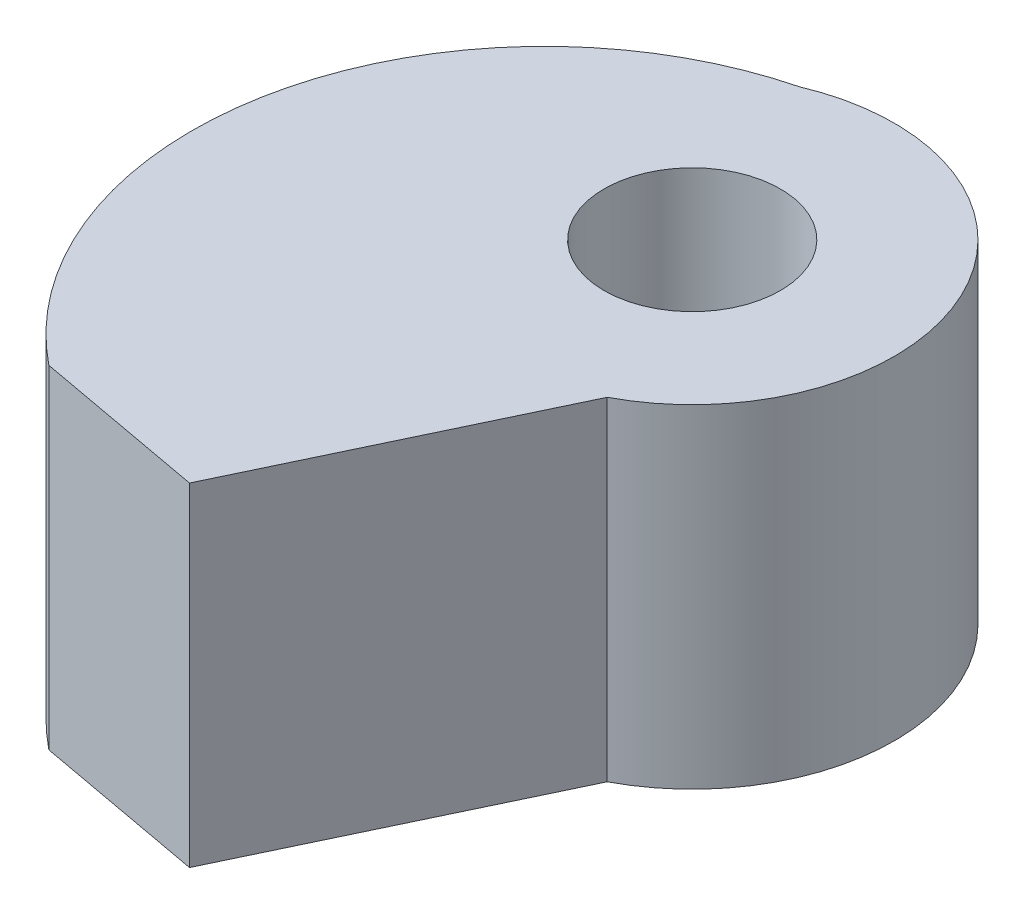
ISO-10303-21;
HEADER;
FILE_DESCRIPTION(('STEP AP214'),'2;1');
FILE_NAME('part.step','',(''),(''),'','','');
FILE_SCHEMA(('AUTOMOTIVE_DESIGN { 1 0 10303 214 1 1 1 1 }'));
ENDSEC;
DATA;
#1=APPLICATION_CONTEXT('core data for automotive mechanical design processes');
#2=APPLICATION_PROTOCOL_DEFINITION('international standard','automotive_design',2000,#1);
#3=PRODUCT_CONTEXT('',#1,'mechanical');
#4=PRODUCT('Part','Part','',(#3));
#5=PRODUCT_RELATED_PRODUCT_CATEGORY('part','',(#4));
#6=PRODUCT_DEFINITION_FORMATION('','',#4);
#7=PRODUCT_DEFINITION_CONTEXT('part definition',#1,'design');
#8=PRODUCT_DEFINITION('design','',#6,#7);
#9=PRODUCT_DEFINITION_SHAPE('','',#8);
#10=(LENGTH_UNIT() NAMED_UNIT(*) SI_UNIT(.MILLI.,.METRE.));
#11=(NAMED_UNIT(*) PLANE_ANGLE_UNIT() SI_UNIT($,.RADIAN.));
#12=(NAMED_UNIT(*) SI_UNIT($,.STERADIAN.) SOLID_ANGLE_UNIT());
#13=UNCERTAINTY_MEASURE_WITH_UNIT(LENGTH_MEASURE(1.E-05),#10,'distance_accuracy_value','');
#14=(GEOMETRIC_REPRESENTATION_CONTEXT(3) GLOBAL_UNCERTAINTY_ASSIGNED_CONTEXT((#13)) GLOBAL_UNIT_ASSIGNED_CONTEXT((#10,
#11,#12)) REPRESENTATION_CONTEXT('',''));
#15=CARTESIAN_POINT('',(0.,0.,0.));
#16=DIRECTION('',(0.,0.,1.));
#17=DIRECTION('',(1.,0.,0.));
#18=AXIS2_PLACEMENT_3D('',#15,#16,#17);
#19=CARTESIAN_POINT('',(0.,8.5,0.));
#20=DIRECTION('',(0.,-1.,0.));
#21=DIRECTION('',(0.,0.,-1.));
#22=AXIS2_PLACEMENT_3D('',#19,#20,#21);
#23=CYLINDRICAL_SURFACE('',#22,1.);
#24=CARTESIAN_POINT('',(0.,2.5,0.));
#25=DIRECTION('',(0.,1.,0.));
#26=DIRECTION('',(0.,0.,1.));
#27=AXIS2_PLACEMENT_3D('',#24,#25,#26);
#28=CIRCLE('',#27,1.);
#29=CARTESIAN_POINT('',(0.,2.5,1.));
#30=VERTEX_POINT('',#29);
#31=EDGE_CURVE('E113',#30,#30,#28,.T.);
#32=ORIENTED_EDGE('',*,*,#31,.F.);
#33=EDGE_LOOP('',(#32));
#34=FACE_BOUND('',#33,.T.);
#35=CARTESIAN_POINT('',(0.,3.,0.));
#36=DIRECTION('',(0.,1.,0.));
#37=DIRECTION('',(0.,0.,1.));
#38=AXIS2_PLACEMENT_3D('',#35,#36,#37);
#39=CIRCLE('',#38,1.);
#40=CARTESIAN_POINT('',(0.,3.,1.));
#41=VERTEX_POINT('',#40);
#42=EDGE_CURVE('E36',#41,#41,#39,.T.);
#43=ORIENTED_EDGE('',*,*,#42,.T.);
#44=EDGE_LOOP('',(#43));
#45=FACE_BOUND('',#44,.T.);
#46=ADVANCED_FACE('F32',(#34,#45),#23,.F.);
#47=CARTESIAN_POINT('',(0.,0.,0.));
#48=DIRECTION('',(0.,1.,0.));
#49=DIRECTION('',(0.,0.,1.));
#50=AXIS2_PLACEMENT_3D('',#47,#48,#49);
#51=PLANE('',#50);
#52=CARTESIAN_POINT('',(0.203781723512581,0.,3.97236403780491));
#53=DIRECTION('',(0.,1.,0.));
#54=DIRECTION('',(0.,0.,1.));
#55=AXIS2_PLACEMENT_3D('',#52,#53,#54);
#56=CIRCLE('',#55,9.);
#57=CARTESIAN_POINT('',(-2.00503937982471,0.,-4.75237718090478));
#58=VERTEX_POINT('',#57);
#59=CARTESIAN_POINT('',(-5.4353253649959,0.,10.9866687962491));
#60=VERTEX_POINT('',#59);
#61=EDGE_CURVE('E75',#58,#60,#56,.T.);
#62=ORIENTED_EDGE('',*,*,#61,.F.);
#63=CARTESIAN_POINT('',(0.,0.,0.));
#64=DIRECTION('',(0.,1.,0.));
#65=DIRECTION('',(0.,0.,1.));
#66=AXIS2_PLACEMENT_3D('',#63,#64,#65);
#67=CIRCLE('',#66,5.15802983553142);
#68=CARTESIAN_POINT('',(2.39759017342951,0.,4.56692819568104));
#69=VERTEX_POINT('',#68);
#70=EDGE_CURVE('E11',#69,#58,#67,.T.);
#71=ORIENTED_EDGE('',*,*,#70,.F.);
#72=DIRECTION('',(0.429321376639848,0.,-0.903151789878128));
#73=VECTOR('',#72,1.);
#74=CARTESIAN_POINT('',(-1.03779561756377,0.,11.7938565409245));
#75=LINE('',#74,#73);
#76=CARTESIAN_POINT('',(-1.03779561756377,0.,11.7938565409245));
#77=VERTEX_POINT('',#76);
#78=EDGE_CURVE('E91',#77,#69,#75,.T.);
#79=ORIENTED_EDGE('',*,*,#78,.F.);
#80=DIRECTION('',(0.983567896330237,0.,0.180538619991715));
#81=VECTOR('',#80,1.);
#82=CARTESIAN_POINT('',(-5.4353253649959,0.,10.9866687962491));
#83=LINE('',#82,#81);
#84=EDGE_CURVE('E84',#60,#77,#83,.T.);
#85=ORIENTED_EDGE('',*,*,#84,.F.);
#86=EDGE_LOOP('',(#62,#71,#79,#85));
#87=FACE_BOUND('',#86,.T.);
#88=CARTESIAN_POINT('',(0.,0.,0.));
#89=DIRECTION('',(0.,1.,0.));
#90=DIRECTION('',(0.,0.,1.));
#91=AXIS2_PLACEMENT_3D('',#88,#89,#90);
#92=CIRCLE('',#91,2.45);
#93=CARTESIAN_POINT('',(0.,0.,2.45));
#94=VERTEX_POINT('',#93);
#95=EDGE_CURVE('E41',#94,#94,#92,.T.);
#96=ORIENTED_EDGE('',*,*,#95,.T.);
#97=EDGE_LOOP('',(#96));
#98=FACE_BOUND('',#97,.T.);
#99=ADVANCED_FACE('F94',(#87,#98),#51,.F.);
#100=CARTESIAN_POINT('',(0.,2.5,0.));
#101=DIRECTION('',(0.,-1.,0.));
#102=DIRECTION('',(0.,0.,-1.));
#103=AXIS2_PLACEMENT_3D('',#100,#101,#102);
#104=CYLINDRICAL_SURFACE('',#103,5.15802983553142);
#105=ORIENTED_EDGE('',*,*,#70,.T.);
#106=DIRECTION('',(0.,1.,0.));
#107=VECTOR('',#106,1.);
#108=CARTESIAN_POINT('',(-2.0050393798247,4.25,-4.75237718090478));
#109=LINE('',#108,#107);
#110=CARTESIAN_POINT('',(-2.0050393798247,8.5,-4.75237718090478));
#111=VERTEX_POINT('',#110);
#112=EDGE_CURVE('E81',#58,#111,#109,.T.);
#113=ORIENTED_EDGE('',*,*,#112,.T.);
#114=CARTESIAN_POINT('',(0.,8.5,0.));
#115=DIRECTION('',(0.,1.,0.));
#116=DIRECTION('',(0.,0.,1.));
#117=AXIS2_PLACEMENT_3D('',#114,#115,#116);
#118=CIRCLE('',#117,5.15802983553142);
#119=CARTESIAN_POINT('',(2.39759017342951,8.5,4.56692819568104));
#120=VERTEX_POINT('',#119);
#121=EDGE_CURVE('E116',#120,#111,#118,.T.);
#122=ORIENTED_EDGE('',*,*,#121,.F.);
#123=DIRECTION('',(0.,1.,0.));
#124=VECTOR('',#123,1.);
#125=CARTESIAN_POINT('',(2.39759017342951,0.,4.56692819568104));
#126=LINE('',#125,#124);
#127=EDGE_CURVE('E103',#69,#120,#126,.T.);
#128=ORIENTED_EDGE('',*,*,#127,.F.);
#129=EDGE_LOOP('',(#105,#113,#122,#128));
#130=FACE_BOUND('',#129,.T.);
#131=ADVANCED_FACE('F34',(#130),#104,.T.);
#132=CARTESIAN_POINT('',(0.,2.5,0.));
#133=DIRECTION('',(0.,-1.,0.));
#134=DIRECTION('',(0.,0.,-1.));
#135=AXIS2_PLACEMENT_3D('',#132,#133,#134);
#136=CYLINDRICAL_SURFACE('',#135,2.45);
#137=CARTESIAN_POINT('',(0.,2.5,0.));
#138=DIRECTION('',(0.,1.,0.));
#139=DIRECTION('',(0.,0.,1.));
#140=AXIS2_PLACEMENT_3D('',#137,#138,#139);
#141=CIRCLE('',#140,2.45);
#142=CARTESIAN_POINT('',(0.,2.5,2.45));
#143=VERTEX_POINT('',#142);
#144=EDGE_CURVE('E118',#143,#143,#141,.T.);
#145=ORIENTED_EDGE('',*,*,#144,.T.);
#146=EDGE_LOOP('',(#145));
#147=FACE_BOUND('',#146,.T.);
#148=ORIENTED_EDGE('',*,*,#95,.F.);
#149=EDGE_LOOP('',(#148));
#150=FACE_BOUND('',#149,.T.);
#151=ADVANCED_FACE('F124',(#147,#150),#136,.F.);
#152=CARTESIAN_POINT('',(0.,2.5,0.));
#153=DIRECTION('',(0.,1.,0.));
#154=DIRECTION('',(0.,0.,1.));
#155=AXIS2_PLACEMENT_3D('',#152,#153,#154);
#156=PLANE('',#155);
#157=ORIENTED_EDGE('',*,*,#31,.T.);
#158=EDGE_LOOP('',(#157));
#159=FACE_BOUND('',#158,.T.);
#160=ORIENTED_EDGE('',*,*,#144,.F.);
#161=EDGE_LOOP('',(#160));
#162=FACE_BOUND('',#161,.T.);
#163=ADVANCED_FACE('F126',(#159,#162),#156,.F.);
#164=CARTESIAN_POINT('',(0.,8.5,0.));
#165=DIRECTION('',(0.,1.,0.));
#166=DIRECTION('',(0.,0.,1.));
#167=AXIS2_PLACEMENT_3D('',#164,#165,#166);
#168=PLANE('',#167);
#169=ORIENTED_EDGE('',*,*,#121,.T.);
#170=CARTESIAN_POINT('',(0.203781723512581,8.5,3.97236403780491));
#171=DIRECTION('',(0.,1.,0.));
#172=DIRECTION('',(0.,0.,1.));
#173=AXIS2_PLACEMENT_3D('',#170,#171,#172);
#174=CIRCLE('',#173,9.);
#175=CARTESIAN_POINT('',(-5.4353253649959,8.5,10.9866687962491));
#176=VERTEX_POINT('',#175);
#177=EDGE_CURVE('E99',#111,#176,#174,.T.);
#178=ORIENTED_EDGE('',*,*,#177,.T.);
#179=DIRECTION('',(0.983567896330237,0.,0.180538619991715));
#180=VECTOR('',#179,1.);
#181=CARTESIAN_POINT('',(-5.4353253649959,8.5,10.9866687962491));
#182=LINE('',#181,#180);
#183=CARTESIAN_POINT('',(-1.03779561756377,8.5,11.7938565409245));
#184=VERTEX_POINT('',#183);
#185=EDGE_CURVE('E89',#176,#184,#182,.T.);
#186=ORIENTED_EDGE('',*,*,#185,.T.);
#187=DIRECTION('',(0.429321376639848,0.,-0.903151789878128));
#188=VECTOR('',#187,1.);
#189=CARTESIAN_POINT('',(-1.03779561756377,8.5,11.7938565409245));
#190=LINE('',#189,#188);
#191=EDGE_CURVE('E48',#184,#120,#190,.T.);
#192=ORIENTED_EDGE('',*,*,#191,.T.);
#193=EDGE_LOOP('',(#169,#178,#186,#192));
#194=FACE_BOUND('',#193,.T.);
#195=CARTESIAN_POINT('',(0.,8.5,0.));
#196=DIRECTION('',(0.,1.,0.));
#197=DIRECTION('',(0.,0.,1.));
#198=AXIS2_PLACEMENT_3D('',#195,#196,#197);
#199=CIRCLE('',#198,2.25);
#200=CARTESIAN_POINT('',(0.,8.5,2.25));
#201=VERTEX_POINT('',#200);
#202=EDGE_CURVE('E107',#201,#201,#199,.T.);
#203=ORIENTED_EDGE('',*,*,#202,.F.);
#204=EDGE_LOOP('',(#203));
#205=FACE_BOUND('',#204,.T.);
#206=ADVANCED_FACE('F133',(#194,#205),#168,.T.);
#207=CARTESIAN_POINT('',(0.,3.,0.));
#208=DIRECTION('',(0.,1.,0.));
#209=DIRECTION('',(0.,0.,1.));
#210=AXIS2_PLACEMENT_3D('',#207,#208,#209);
#211=CYLINDRICAL_SURFACE('',#210,2.25);
#212=CARTESIAN_POINT('',(0.,3.,0.));
#213=DIRECTION('',(0.,1.,0.));
#214=DIRECTION('',(0.,0.,1.));
#215=AXIS2_PLACEMENT_3D('',#212,#213,#214);
#216=CIRCLE('',#215,2.25);
#217=CARTESIAN_POINT('',(0.,3.,2.25));
#218=VERTEX_POINT('',#217);
#219=EDGE_CURVE('E108',#218,#218,#216,.T.);
#220=ORIENTED_EDGE('',*,*,#219,.F.);
#221=EDGE_LOOP('',(#220));
#222=FACE_BOUND('',#221,.T.);
#223=ORIENTED_EDGE('',*,*,#202,.T.);
#224=EDGE_LOOP('',(#223));
#225=FACE_BOUND('',#224,.T.);
#226=ADVANCED_FACE('F146',(#222,#225),#211,.F.);
#227=CARTESIAN_POINT('',(0.,3.,0.));
#228=DIRECTION('',(0.,1.,0.));
#229=DIRECTION('',(0.,0.,1.));
#230=AXIS2_PLACEMENT_3D('',#227,#228,#229);
#231=PLANE('',#230);
#232=ORIENTED_EDGE('',*,*,#42,.F.);
#233=EDGE_LOOP('',(#232));
#234=FACE_BOUND('',#233,.T.);
#235=ORIENTED_EDGE('',*,*,#219,.T.);
#236=EDGE_LOOP('',(#235));
#237=FACE_BOUND('',#236,.T.);
#238=ADVANCED_FACE('F152',(#234,#237),#231,.T.);
#239=CARTESIAN_POINT('',(0.203781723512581,0.,3.97236403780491));
#240=DIRECTION('',(0.,1.,0.));
#241=DIRECTION('',(0.,0.,1.));
#242=AXIS2_PLACEMENT_3D('',#239,#240,#241);
#243=CYLINDRICAL_SURFACE('',#242,9.);
#244=ORIENTED_EDGE('',*,*,#112,.F.);
#245=ORIENTED_EDGE('',*,*,#61,.T.);
#246=DIRECTION('',(0.,1.,0.));
#247=VECTOR('',#246,1.);
#248=CARTESIAN_POINT('',(-5.4353253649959,0.,10.9866687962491));
#249=LINE('',#248,#247);
#250=EDGE_CURVE('E79',#60,#176,#249,.T.);
#251=ORIENTED_EDGE('',*,*,#250,.T.);
#252=ORIENTED_EDGE('',*,*,#177,.F.);
#253=EDGE_LOOP('',(#244,#245,#251,#252));
#254=FACE_BOUND('',#253,.T.);
#255=ADVANCED_FACE('F77',(#254),#243,.T.);
#256=CARTESIAN_POINT('',(-1.03779561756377,0.,11.7938565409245));
#257=DIRECTION('',(0.903151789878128,0.,0.429321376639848));
#258=DIRECTION('',(0.429321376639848,0.,-0.903151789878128));
#259=AXIS2_PLACEMENT_3D('',#256,#257,#258);
#260=PLANE('',#259);
#261=ORIENTED_EDGE('',*,*,#191,.F.);
#262=DIRECTION('',(0.,1.,0.));
#263=VECTOR('',#262,1.);
#264=CARTESIAN_POINT('',(-1.03779561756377,0.,11.7938565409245));
#265=LINE('',#264,#263);
#266=EDGE_CURVE('E90',#77,#184,#265,.T.);
#267=ORIENTED_EDGE('',*,*,#266,.F.);
#268=ORIENTED_EDGE('',*,*,#78,.T.);
#269=ORIENTED_EDGE('',*,*,#127,.T.);
#270=EDGE_LOOP('',(#261,#267,#268,#269));
#271=FACE_BOUND('',#270,.T.);
#272=ADVANCED_FACE('F159',(#271),#260,.T.);
#273=CARTESIAN_POINT('',(-5.4353253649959,0.,10.9866687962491));
#274=DIRECTION('',(-0.180538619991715,0.,0.983567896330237));
#275=DIRECTION('',(0.983567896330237,0.,0.180538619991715));
#276=AXIS2_PLACEMENT_3D('',#273,#274,#275);
#277=PLANE('',#276);
#278=ORIENTED_EDGE('',*,*,#185,.F.);
#279=ORIENTED_EDGE('',*,*,#250,.F.);
#280=ORIENTED_EDGE('',*,*,#84,.T.);
#281=ORIENTED_EDGE('',*,*,#266,.T.);
#282=EDGE_LOOP('',(#278,#279,#280,#281));
#283=FACE_BOUND('',#282,.T.);
#284=ADVANCED_FACE('F88',(#283),#277,.T.);
#285=CLOSED_SHELL('',(#46,#99,#131,#151,#163,#206,#226,#238,#255,#272,#284));
#286=MANIFOLD_SOLID_BREP('B2',#285);
#287=ADVANCED_BREP_SHAPE_REPRESENTATION('',(#18,#286),#14);
#288=SHAPE_DEFINITION_REPRESENTATION(#9,#287);
ENDSEC;
END-ISO-10303-21;
